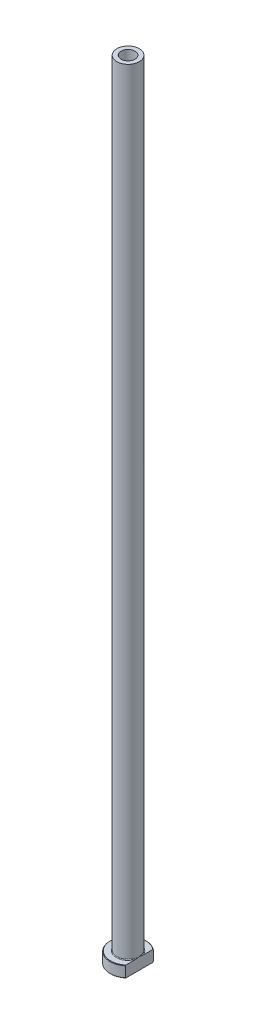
ISO-10303-21;
HEADER;
FILE_DESCRIPTION(('STEP AP214'),'2;1');
FILE_NAME('part.step','',(''),(''),'','','');
FILE_SCHEMA(('AUTOMOTIVE_DESIGN { 1 0 10303 214 1 1 1 1 }'));
ENDSEC;
DATA;
#1=APPLICATION_CONTEXT('core data for automotive mechanical design processes');
#2=APPLICATION_PROTOCOL_DEFINITION('international standard','automotive_design',2000,#1);
#3=PRODUCT_CONTEXT('',#1,'mechanical');
#4=PRODUCT('Part','Part','',(#3));
#5=PRODUCT_RELATED_PRODUCT_CATEGORY('part','',(#4));
#6=PRODUCT_DEFINITION_FORMATION('','',#4);
#7=PRODUCT_DEFINITION_CONTEXT('part definition',#1,'design');
#8=PRODUCT_DEFINITION('design','',#6,#7);
#9=PRODUCT_DEFINITION_SHAPE('','',#8);
#10=(LENGTH_UNIT() NAMED_UNIT(*) SI_UNIT(.MILLI.,.METRE.));
#11=(NAMED_UNIT(*) PLANE_ANGLE_UNIT() SI_UNIT($,.RADIAN.));
#12=(NAMED_UNIT(*) SI_UNIT($,.STERADIAN.) SOLID_ANGLE_UNIT());
#13=UNCERTAINTY_MEASURE_WITH_UNIT(LENGTH_MEASURE(1.E-05),#10,'distance_accuracy_value','');
#14=(GEOMETRIC_REPRESENTATION_CONTEXT(3) GLOBAL_UNCERTAINTY_ASSIGNED_CONTEXT((#13)) GLOBAL_UNIT_ASSIGNED_CONTEXT((#10,
#11,#12)) REPRESENTATION_CONTEXT('',''));
#15=CARTESIAN_POINT('',(0.,0.,0.));
#16=DIRECTION('',(0.,0.,1.));
#17=DIRECTION('',(1.,0.,0.));
#18=AXIS2_PLACEMENT_3D('',#15,#16,#17);
#19=CARTESIAN_POINT('',(0.,92.1876809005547,0.));
#20=DIRECTION('',(0.,1.,0.));
#21=DIRECTION('',(0.,0.,1.));
#22=AXIS2_PLACEMENT_3D('',#19,#20,#21);
#23=CYLINDRICAL_SURFACE('',#22,3.10000000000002);
#24=CARTESIAN_POINT('',(0.,350.,0.));
#25=DIRECTION('',(0.,1.,0.));
#26=DIRECTION('',(0.,0.,1.));
#27=AXIS2_PLACEMENT_3D('',#24,#25,#26);
#28=CIRCLE('',#27,3.10000000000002);
#29=CARTESIAN_POINT('',(0.,350.,3.10000000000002));
#30=VERTEX_POINT('',#29);
#31=EDGE_CURVE('E167',#30,#30,#28,.T.);
#32=ORIENTED_EDGE('',*,*,#31,.T.);
#33=EDGE_LOOP('',(#32));
#34=FACE_BOUND('',#33,.T.);
#35=CARTESIAN_POINT('',(0.,305.,0.));
#36=DIRECTION('',(0.,1.,0.));
#37=DIRECTION('',(0.,0.,1.));
#38=AXIS2_PLACEMENT_3D('',#35,#36,#37);
#39=CIRCLE('',#38,3.10000000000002);
#40=CARTESIAN_POINT('',(0.,305.,3.10000000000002));
#41=VERTEX_POINT('',#40);
#42=EDGE_CURVE('E170',#41,#41,#39,.T.);
#43=ORIENTED_EDGE('',*,*,#42,.F.);
#44=EDGE_LOOP('',(#43));
#45=FACE_BOUND('',#44,.T.);
#46=ADVANCED_FACE('F32',(#34,#45),#23,.F.);
#47=CARTESIAN_POINT('',(-3.10000000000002,350.,0.));
#48=DIRECTION('',(0.,1.,0.));
#49=DIRECTION('',(0.,0.,1.));
#50=AXIS2_PLACEMENT_3D('',#47,#48,#49);
#51=PLANE('',#50);
#52=CARTESIAN_POINT('',(0.,350.,0.));
#53=DIRECTION('',(0.,1.,0.));
#54=DIRECTION('',(0.,0.,1.));
#55=AXIS2_PLACEMENT_3D('',#52,#53,#54);
#56=CIRCLE('',#55,5.00000000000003);
#57=CARTESIAN_POINT('',(0.,350.,5.00000000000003));
#58=VERTEX_POINT('',#57);
#59=EDGE_CURVE('E174',#58,#58,#56,.T.);
#60=ORIENTED_EDGE('',*,*,#59,.T.);
#61=EDGE_LOOP('',(#60));
#62=FACE_BOUND('',#61,.T.);
#63=ORIENTED_EDGE('',*,*,#31,.F.);
#64=EDGE_LOOP('',(#63));
#65=FACE_BOUND('',#64,.T.);
#66=ADVANCED_FACE('F157',(#62,#65),#51,.T.);
#67=CARTESIAN_POINT('',(0.,92.1876809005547,0.));
#68=DIRECTION('',(0.,1.,0.));
#69=DIRECTION('',(0.,0.,1.));
#70=AXIS2_PLACEMENT_3D('',#67,#68,#69);
#71=CYLINDRICAL_SURFACE('',#70,5.00000000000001);
#72=CARTESIAN_POINT('',(0.,5.3,0.));
#73=DIRECTION('',(0.,1.,0.));
#74=DIRECTION('',(0.,0.,1.));
#75=AXIS2_PLACEMENT_3D('',#72,#73,#74);
#76=CIRCLE('',#75,5.00000000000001);
#77=CARTESIAN_POINT('',(5.,5.3,0.));
#78=VERTEX_POINT('',#77);
#79=EDGE_CURVE('E180',#78,#78,#76,.T.);
#80=ORIENTED_EDGE('',*,*,#79,.T.);
#81=EDGE_LOOP('',(#80));
#82=FACE_BOUND('',#81,.T.);
#83=ORIENTED_EDGE('',*,*,#59,.F.);
#84=EDGE_LOOP('',(#83));
#85=FACE_BOUND('',#84,.T.);
#86=ADVANCED_FACE('F162',(#82,#85),#71,.T.);
#87=CARTESIAN_POINT('',(-4.99999999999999,5.,0.));
#88=DIRECTION('',(0.,1.,0.));
#89=DIRECTION('',(0.,0.,1.));
#90=AXIS2_PLACEMENT_3D('',#87,#88,#89);
#91=PLANE('',#90);
#92=DIRECTION('',(0.,0.,1.));
#93=VECTOR('',#92,1.);
#94=CARTESIAN_POINT('',(5.,5.,0.));
#95=LINE('',#94,#93);
#96=CARTESIAN_POINT('',(5.,5.,-5.98665181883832));
#97=VERTEX_POINT('',#96);
#98=CARTESIAN_POINT('',(5.,5.,-1.75783958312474));
#99=VERTEX_POINT('',#98);
#100=EDGE_CURVE('E54',#97,#99,#95,.T.);
#101=ORIENTED_EDGE('',*,*,#100,.F.);
#102=CARTESIAN_POINT('',(0.,5.,0.));
#103=DIRECTION('',(0.,1.,0.));
#104=DIRECTION('',(0.,0.,1.));
#105=AXIS2_PLACEMENT_3D('',#102,#103,#104);
#106=CIRCLE('',#105,7.80000000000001);
#107=CARTESIAN_POINT('',(4.99999999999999,5.,5.98665181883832));
#108=VERTEX_POINT('',#107);
#109=EDGE_CURVE('E186',#97,#108,#106,.T.);
#110=ORIENTED_EDGE('',*,*,#109,.T.);
#111=CARTESIAN_POINT('',(5.,5.,1.75783958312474));
#112=VERTEX_POINT('',#111);
#113=EDGE_CURVE('E134',#112,#108,#95,.T.);
#114=ORIENTED_EDGE('',*,*,#113,.F.);
#115=CARTESIAN_POINT('',(0.,5.,0.));
#116=DIRECTION('',(0.,1.,0.));
#117=DIRECTION('',(0.,0.,1.));
#118=AXIS2_PLACEMENT_3D('',#115,#116,#117);
#119=CIRCLE('',#118,5.30000000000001);
#120=EDGE_CURVE('E183',#112,#99,#119,.F.);
#121=ORIENTED_EDGE('',*,*,#120,.T.);
#122=EDGE_LOOP('',(#101,#110,#114,#121));
#123=FACE_BOUND('',#122,.T.);
#124=ADVANCED_FACE('F197',(#123),#91,.T.);
#125=CARTESIAN_POINT('',(0.,92.1876809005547,0.));
#126=DIRECTION('',(0.,1.,0.));
#127=DIRECTION('',(0.,0.,1.));
#128=AXIS2_PLACEMENT_3D('',#125,#126,#127);
#129=CYLINDRICAL_SURFACE('',#128,7.99999999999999);
#130=DIRECTION('',(0.,-1.,0.));
#131=VECTOR('',#130,1.);
#132=CARTESIAN_POINT('',(4.99999999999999,350.,6.24499799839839));
#133=LINE('',#132,#131);
#134=CARTESIAN_POINT('',(4.99999999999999,4.80000000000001,6.24499799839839));
#135=VERTEX_POINT('',#134);
#136=CARTESIAN_POINT('',(4.99999999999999,0.20000000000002,6.24499799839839));
#137=VERTEX_POINT('',#136);
#138=EDGE_CURVE('E82',#135,#137,#133,.T.);
#139=ORIENTED_EDGE('',*,*,#138,.F.);
#140=CARTESIAN_POINT('',(0.,4.80000000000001,0.));
#141=DIRECTION('',(0.,1.,0.));
#142=DIRECTION('',(0.,0.,1.));
#143=AXIS2_PLACEMENT_3D('',#140,#141,#142);
#144=CIRCLE('',#143,7.99999999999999);
#145=CARTESIAN_POINT('',(5.,4.80000000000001,-6.24499799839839));
#146=VERTEX_POINT('',#145);
#147=EDGE_CURVE('E95',#135,#146,#144,.F.);
#148=ORIENTED_EDGE('',*,*,#147,.T.);
#149=DIRECTION('',(0.,-1.,0.));
#150=VECTOR('',#149,1.);
#151=CARTESIAN_POINT('',(5.,350.,-6.24499799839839));
#152=LINE('',#151,#150);
#153=CARTESIAN_POINT('',(5.,0.20000000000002,-6.24499799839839));
#154=VERTEX_POINT('',#153);
#155=EDGE_CURVE('E192',#146,#154,#152,.T.);
#156=ORIENTED_EDGE('',*,*,#155,.T.);
#157=CARTESIAN_POINT('',(0.,0.20000000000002,0.));
#158=DIRECTION('',(0.,-1.,0.));
#159=DIRECTION('',(0.,0.,-1.));
#160=AXIS2_PLACEMENT_3D('',#157,#158,#159);
#161=CIRCLE('',#160,7.99999999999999);
#162=EDGE_CURVE('E98',#154,#137,#161,.F.);
#163=ORIENTED_EDGE('',*,*,#162,.T.);
#164=EDGE_LOOP('',(#139,#148,#156,#163));
#165=FACE_BOUND('',#164,.T.);
#166=ADVANCED_FACE('F190',(#165),#129,.T.);
#167=CARTESIAN_POINT('',(-7.99999999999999,0.,0.));
#168=DIRECTION('',(0.,-1.,0.));
#169=DIRECTION('',(0.,0.,-1.));
#170=AXIS2_PLACEMENT_3D('',#167,#168,#169);
#171=PLANE('',#170);
#172=CARTESIAN_POINT('',(0.,0.,0.));
#173=DIRECTION('',(0.,-1.,0.));
#174=DIRECTION('',(0.,0.,-1.));
#175=AXIS2_PLACEMENT_3D('',#172,#173,#174);
#176=CIRCLE('',#175,3.84999999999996);
#177=CARTESIAN_POINT('',(0.,0.,-3.84999999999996));
#178=VERTEX_POINT('',#177);
#179=EDGE_CURVE('E40',#178,#178,#176,.F.);
#180=ORIENTED_EDGE('',*,*,#179,.T.);
#181=EDGE_LOOP('',(#180));
#182=FACE_BOUND('',#181,.T.);
#183=DIRECTION('',(0.,0.,-1.));
#184=VECTOR('',#183,1.);
#185=CARTESIAN_POINT('',(4.99999999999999,0.,6.24499799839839));
#186=LINE('',#185,#184);
#187=CARTESIAN_POINT('',(4.99999999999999,0.,5.98665181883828));
#188=VERTEX_POINT('',#187);
#189=CARTESIAN_POINT('',(5.,0.,-5.98665181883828));
#190=VERTEX_POINT('',#189);
#191=EDGE_CURVE('E47',#188,#190,#186,.T.);
#192=ORIENTED_EDGE('',*,*,#191,.F.);
#193=CARTESIAN_POINT('',(0.,0.,0.));
#194=DIRECTION('',(0.,-1.,0.));
#195=DIRECTION('',(0.,0.,-1.));
#196=AXIS2_PLACEMENT_3D('',#193,#194,#195);
#197=CIRCLE('',#196,7.79999999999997);
#198=EDGE_CURVE('E92',#188,#190,#197,.T.);
#199=ORIENTED_EDGE('',*,*,#198,.T.);
#200=EDGE_LOOP('',(#192,#199));
#201=FACE_BOUND('',#200,.T.);
#202=ADVANCED_FACE('F91',(#182,#201),#171,.T.);
#203=CARTESIAN_POINT('',(0.,92.1876809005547,0.));
#204=DIRECTION('',(0.,1.,0.));
#205=DIRECTION('',(0.,0.,1.));
#206=AXIS2_PLACEMENT_3D('',#203,#204,#205);
#207=CYLINDRICAL_SURFACE('',#206,3.35000000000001);
#208=CARTESIAN_POINT('',(0.,0.499999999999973,0.));
#209=DIRECTION('',(0.,-1.,0.));
#210=DIRECTION('',(0.,0.,-1.));
#211=AXIS2_PLACEMENT_3D('',#208,#209,#210);
#212=CIRCLE('',#211,3.35000000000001);
#213=CARTESIAN_POINT('',(0.,0.499999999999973,-3.35000000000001));
#214=VERTEX_POINT('',#213);
#215=EDGE_CURVE('E11',#214,#214,#212,.T.);
#216=ORIENTED_EDGE('',*,*,#215,.T.);
#217=EDGE_LOOP('',(#216));
#218=FACE_BOUND('',#217,.T.);
#219=CARTESIAN_POINT('',(0.,293.,0.));
#220=DIRECTION('',(0.,1.,0.));
#221=DIRECTION('',(0.,0.,1.));
#222=AXIS2_PLACEMENT_3D('',#219,#220,#221);
#223=CIRCLE('',#222,3.35000000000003);
#224=CARTESIAN_POINT('',(0.,293.,3.35000000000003));
#225=VERTEX_POINT('',#224);
#226=EDGE_CURVE('E172',#225,#225,#223,.T.);
#227=ORIENTED_EDGE('',*,*,#226,.T.);
#228=EDGE_LOOP('',(#227));
#229=FACE_BOUND('',#228,.T.);
#230=ADVANCED_FACE('F215',(#218,#229),#207,.F.);
#231=CARTESIAN_POINT('',(0.,293.,0.));
#232=DIRECTION('',(0.,-1.,0.));
#233=DIRECTION('',(0.,0.,-1.));
#234=AXIS2_PLACEMENT_3D('',#231,#232,#233);
#235=CONICAL_SURFACE('',#234,3.35000000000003,0.0208303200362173);
#236=ORIENTED_EDGE('',*,*,#42,.T.);
#237=EDGE_LOOP('',(#236));
#238=FACE_BOUND('',#237,.T.);
#239=ORIENTED_EDGE('',*,*,#226,.F.);
#240=EDGE_LOOP('',(#239));
#241=FACE_BOUND('',#240,.T.);
#242=ADVANCED_FACE('F111',(#238,#241),#235,.F.);
#243=CARTESIAN_POINT('',(0.,5.3,0.));
#244=DIRECTION('',(0.,1.,0.));
#245=DIRECTION('',(0.,0.,1.));
#246=AXIS2_PLACEMENT_3D('',#243,#244,#245);
#247=TOROIDAL_SURFACE('',#246,5.30000000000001,0.3);
#248=ORIENTED_EDGE('',*,*,#120,.F.);
#249=CARTESIAN_POINT('',(5.,5.3,0.));
#250=CARTESIAN_POINT('',(5.,5.3000006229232,-1.3146900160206E-10));
#251=CARTESIAN_POINT('',(5.,5.30000124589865,2.5275949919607E-07));
#252=CARTESIAN_POINT('',(5.,5.30000240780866,9.47164923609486E-07));
#253=CARTESIAN_POINT('',(5.,5.30000293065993,1.40594102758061E-06));
#254=CARTESIAN_POINT('',(5.,5.30000402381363,2.50637697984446E-06));
#255=CARTESIAN_POINT('',(5.,5.30000457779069,3.16589020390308E-06));
#256=CARTESIAN_POINT('',(5.,5.30000556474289,4.52860090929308E-06));
#257=CARTESIAN_POINT('',(5.,5.30000600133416,5.22939564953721E-06));
#258=CARTESIAN_POINT('',(5.,5.30000763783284,7.96122182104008E-06));
#259=CARTESIAN_POINT('',(5.,5.30000875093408,1.00477434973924E-05));
#260=CARTESIAN_POINT('',(5.,5.30001056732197,1.41660902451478E-05));
#261=CARTESIAN_POINT('',(5.,5.30001129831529,1.61861809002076E-05));
#262=CARTESIAN_POINT('',(5.,5.30001439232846,2.47865783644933E-05));
#263=CARTESIAN_POINT('',(5.,5.3000167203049,3.13830342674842E-05));
#264=CARTESIAN_POINT('',(5.,5.30002012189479,4.38084288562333E-05));
#265=CARTESIAN_POINT('',(5.,5.30002133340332,4.95992799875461E-05));
#266=CARTESIAN_POINT('',(5.,5.30003020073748,9.27862708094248E-05));
#267=CARTESIAN_POINT('',(5.,5.30003696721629,0.000130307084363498));
#268=CARTESIAN_POINT('',(4.99999999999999,5.30006659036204,0.000278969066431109));
#269=CARTESIAN_POINT('',(4.99999999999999,5.30009481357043,0.000389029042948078));
#270=CARTESIAN_POINT('',(5.,5.30020506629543,0.000826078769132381));
#271=CARTESIAN_POINT('',(5.,5.30028365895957,0.00115365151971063));
#272=CARTESIAN_POINT('',(4.99999999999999,5.30059919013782,0.00245925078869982));
#273=CARTESIAN_POINT('',(4.99999999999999,5.30084048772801,0.00343651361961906));
#274=CARTESIAN_POINT('',(5.,5.30184626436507,0.00752058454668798));
#275=CARTESIAN_POINT('',(5.,5.30260525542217,0.0106283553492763));
#276=CARTESIAN_POINT('',(4.99999999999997,5.30996461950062,0.0407482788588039));
#277=CARTESIAN_POINT('',(4.99999999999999,5.31658985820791,0.0677561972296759));
#278=CARTESIAN_POINT('',(5.,5.32953319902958,0.120688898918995));
#279=CARTESIAN_POINT('',(5.,5.33585289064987,0.146613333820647));
#280=CARTESIAN_POINT('',(4.99999999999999,5.34926050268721,0.201795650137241));
#281=CARTESIAN_POINT('',(4.99999999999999,5.35634306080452,0.231054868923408));
#282=CARTESIAN_POINT('',(5.,5.370502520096,0.289917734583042));
#283=CARTESIAN_POINT('',(5.,5.37757848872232,0.319521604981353));
#284=CARTESIAN_POINT('',(5.,5.39452602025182,0.391032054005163));
#285=CARTESIAN_POINT('',(5.,5.40434071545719,0.432952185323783));
#286=CARTESIAN_POINT('',(5.,5.42340141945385,0.515763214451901));
#287=CARTESIAN_POINT('',(5.,5.43265559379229,0.556652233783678));
#288=CARTESIAN_POINT('',(5.,5.45710553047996,0.667075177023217));
#289=CARTESIAN_POINT('',(5.,5.47194176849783,0.736689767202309));
#290=CARTESIAN_POINT('',(5.,5.50018229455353,0.87683662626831));
#291=CARTESIAN_POINT('',(5.,5.51357312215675,0.947371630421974));
#292=CARTESIAN_POINT('',(5.,5.53930921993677,1.09497328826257));
#293=CARTESIAN_POINT('',(5.,5.55146217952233,1.17207432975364));
#294=CARTESIAN_POINT('',(5.,5.57239669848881,1.32672649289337));
#295=CARTESIAN_POINT('',(5.,5.58117877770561,1.40427754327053));
#296=CARTESIAN_POINT('',(5.,5.59499725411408,1.5687382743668));
#297=CARTESIAN_POINT('',(5.,5.59948802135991,1.6557004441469));
#298=CARTESIAN_POINT('',(5.,5.60018885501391,1.78535304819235));
#299=CARTESIAN_POINT('',(5.,5.59945214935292,1.82802575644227));
#300=CARTESIAN_POINT('',(5.,5.59559364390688,1.9132508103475));
#301=CARTESIAN_POINT('',(5.,5.59247319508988,1.95580321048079));
#302=CARTESIAN_POINT('',(5.,5.58383242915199,2.03512365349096));
#303=CARTESIAN_POINT('',(5.,5.57867386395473,2.07192937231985));
#304=CARTESIAN_POINT('',(5.,5.56543793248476,2.14526756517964));
#305=CARTESIAN_POINT('',(5.,5.55734203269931,2.18179676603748));
#306=CARTESIAN_POINT('',(5.,5.53718005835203,2.25427226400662));
#307=CARTESIAN_POINT('',(5.,5.52507057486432,2.29020746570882));
#308=CARTESIAN_POINT('',(5.,5.50270928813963,2.34223029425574));
#309=CARTESIAN_POINT('',(5.,5.49457811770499,2.35922314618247));
#310=CARTESIAN_POINT('',(5.,5.47657809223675,2.39224900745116));
#311=CARTESIAN_POINT('',(5.,5.4667128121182,2.40828390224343));
#312=CARTESIAN_POINT('',(5.,5.44695893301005,2.43579467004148));
#313=CARTESIAN_POINT('',(5.,5.43745879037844,2.44754592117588));
#314=CARTESIAN_POINT('',(5.,5.41677914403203,2.4694647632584));
#315=CARTESIAN_POINT('',(5.,5.40560543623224,2.47963758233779));
#316=CARTESIAN_POINT('',(5.,5.38617750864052,2.49393642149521));
#317=CARTESIAN_POINT('',(5.,5.37851643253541,2.49886271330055));
#318=CARTESIAN_POINT('',(5.,5.36252740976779,2.50749953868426));
#319=CARTESIAN_POINT('',(5.,5.35419984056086,2.51121075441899));
#320=CARTESIAN_POINT('',(5.,5.3369064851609,2.51712941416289));
#321=CARTESIAN_POINT('',(5.,5.32793451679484,2.51931927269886));
#322=CARTESIAN_POINT('',(5.,5.30973576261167,2.52185978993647));
#323=CARTESIAN_POINT('',(5.,5.3005093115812,2.52221275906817));
#324=CARTESIAN_POINT('',(5.,5.28349166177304,2.52112455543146));
#325=CARTESIAN_POINT('',(5.,5.27568322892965,2.51993178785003));
#326=CARTESIAN_POINT('',(5.,5.26036860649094,2.51628294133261));
#327=CARTESIAN_POINT('',(5.,5.25286261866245,2.51382603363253));
#328=CARTESIAN_POINT('',(5.,5.23590266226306,2.5068548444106));
#329=CARTESIAN_POINT('',(5.,5.22661875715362,2.50192984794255));
#330=CARTESIAN_POINT('',(5.,5.20895514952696,2.49066548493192));
#331=CARTESIAN_POINT('',(5.,5.20057756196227,2.48432291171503));
#332=CARTESIAN_POINT('',(5.,5.17987008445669,2.4664521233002));
#333=CARTESIAN_POINT('',(5.,5.16824151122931,2.45411867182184));
#334=CARTESIAN_POINT('',(5.,5.14692461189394,2.42790849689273));
#335=CARTESIAN_POINT('',(5.,5.13723987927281,2.41402898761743));
#336=CARTESIAN_POINT('',(5.,5.11080706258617,2.37143175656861));
#337=CARTESIAN_POINT('',(5.,5.09628770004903,2.34134703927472));
#338=CARTESIAN_POINT('',(5.,5.07130349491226,2.27940731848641));
#339=CARTESIAN_POINT('',(5.,5.06087110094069,2.24754035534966));
#340=CARTESIAN_POINT('',(5.,5.03890359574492,2.16787245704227));
#341=CARTESIAN_POINT('',(5.,5.02913523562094,2.11959065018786));
#342=CARTESIAN_POINT('',(5.,5.0141695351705,2.02224928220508));
#343=CARTESIAN_POINT('',(5.,5.00898637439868,1.97318778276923));
#344=CARTESIAN_POINT('',(5.,5.00220823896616,1.87635767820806));
#345=CARTESIAN_POINT('',(5.,5.00050709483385,1.82859609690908));
#346=CARTESIAN_POINT('',(5.,4.99969104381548,1.73330165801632));
#347=CARTESIAN_POINT('',(5.,5.00056327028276,1.68576884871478));
#348=CARTESIAN_POINT('',(5.,5.00484296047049,1.57937770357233));
#349=CARTESIAN_POINT('',(5.,5.00880932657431,1.52054285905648));
#350=CARTESIAN_POINT('',(5.,5.01925964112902,1.40312974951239));
#351=CARTESIAN_POINT('',(5.,5.02574264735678,1.34455139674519));
#352=CARTESIAN_POINT('',(5.,5.04090087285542,1.22627662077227));
#353=CARTESIAN_POINT('',(5.,5.04962425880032,1.16658647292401));
#354=CARTESIAN_POINT('',(5.,5.06877923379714,1.04732463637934));
#355=CARTESIAN_POINT('',(5.,5.07921523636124,0.987753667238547));
#356=CARTESIAN_POINT('',(5.,5.10551698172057,0.84693616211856));
#357=CARTESIAN_POINT('',(5.,5.12196565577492,0.765799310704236));
#358=CARTESIAN_POINT('',(5.,5.15639716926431,0.604819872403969));
#359=CARTESIAN_POINT('',(4.99999999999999,5.17436050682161,0.524973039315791));
#360=CARTESIAN_POINT('',(5.,5.20921667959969,0.37472665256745));
#361=CARTESIAN_POINT('',(5.,5.22599388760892,0.304300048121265));
#362=CARTESIAN_POINT('',(4.99999999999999,5.25191105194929,0.196907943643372));
#363=CARTESIAN_POINT('',(4.99999999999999,5.26090146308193,0.159905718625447));
#364=CARTESIAN_POINT('',(5.,5.27881854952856,0.0865164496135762));
#365=CARTESIAN_POINT('',(5.00000000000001,5.2877439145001,0.050129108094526));
#366=CARTESIAN_POINT('',(4.99999999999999,5.29739627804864,0.0106218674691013));
#367=CARTESIAN_POINT('',(4.99999999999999,5.29815688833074,0.00750762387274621));
#368=CARTESIAN_POINT('',(5.,5.29916304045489,0.00342209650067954));
#369=CARTESIAN_POINT('',(5.,5.29940309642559,0.00244985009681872));
#370=CARTESIAN_POINT('',(4.99999999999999,5.29971711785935,0.00115049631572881));
#371=CARTESIAN_POINT('',(4.99999999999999,5.29979541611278,0.000824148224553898));
#372=CARTESIAN_POINT('',(5.,5.29990531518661,0.00038852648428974));
#373=CARTESIAN_POINT('',(5.,5.29993348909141,0.000278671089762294));
#374=CARTESIAN_POINT('',(5.,5.29996306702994,0.000130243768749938));
#375=CARTESIAN_POINT('',(4.99999999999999,5.29996982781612,9.27511472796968E-05));
#376=CARTESIAN_POINT('',(5.,5.29997868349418,4.95929950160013E-05));
#377=CARTESIAN_POINT('',(5.,5.29997989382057,4.38036623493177E-05));
#378=CARTESIAN_POINT('',(5.,5.29998329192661,3.13814244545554E-05));
#379=CARTESIAN_POINT('',(5.,5.29998561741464,2.47865262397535E-05));
#380=CARTESIAN_POINT('',(5.,5.29998870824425,1.61877572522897E-05));
#381=CARTESIAN_POINT('',(5.,5.29998943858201,1.41677797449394E-05));
#382=CARTESIAN_POINT('',(5.,5.29999125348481,1.00495556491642E-05));
#383=CARTESIAN_POINT('',(5.,5.29999236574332,7.9630285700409E-06));
#384=CARTESIAN_POINT('',(5.,5.29999400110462,5.23107535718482E-06));
#385=CARTESIAN_POINT('',(5.,5.29999443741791,4.53021160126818E-06));
#386=CARTESIAN_POINT('',(5.,5.29999542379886,3.1673126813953E-06));
#387=CARTESIAN_POINT('',(5.,5.29999597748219,2.50767819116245E-06));
#388=CARTESIAN_POINT('',(5.,5.29999707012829,1.40695944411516E-06));
#389=CARTESIAN_POINT('',(5.,5.29999759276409,9.48033029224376E-07));
#390=CARTESIAN_POINT('',(5.,5.29999875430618,2.53244607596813E-07));
#391=CARTESIAN_POINT('',(5.,5.29999937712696,1.31459803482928E-10));
#392=CARTESIAN_POINT('',(5.,5.3,0.));
#393=B_SPLINE_CURVE_WITH_KNOTS('',3,(#249,#250,#251,#252,#253,#254,#255,#256,#257,#258,#259,
#260,#261,#262,#263,#264,#265,#266,#267,#268,#269,#270,#271,#272,#273,#274,#275,#276,#277,#278,
#279,#280,#281,#282,#283,#284,#285,#286,#287,#288,#289,#290,#291,#292,#293,#294,#295,#296,#297,
#298,#299,#300,#301,#302,#303,#304,#305,#306,#307,#308,#309,#310,#311,#312,#313,#314,#315,#316,
#317,#318,#319,#320,#321,#322,#323,#324,#325,#326,#327,#328,#329,#330,#331,#332,#333,#334,#335,
#336,#337,#338,#339,#340,#341,#342,#343,#344,#345,#346,#347,#348,#349,#350,#351,#352,#353,#354,
#355,#356,#357,#358,#359,#360,#361,#362,#363,#364,#365,#366,#367,#368,#369,#370,#371,#372,#373,
#374,#375,#376,#377,#378,#379,#380,#381,#382,#383,#384,#385,#386,#387,#388,#389,#390,#391,#392),
.UNSPECIFIED.,.T.,.F.,(4,2,2,2,2,2,2,2,2,2,2,2,2,2,2,2,2,2,2,2,2,2,2,2,2,2,2,2,2,2,2,2,2,2,2,2,
2,2,2,2,2,2,2,2,2,2,2,2,2,2,2,2,2,2,2,2,2,2,2,2,2,2,2,2,2,2,2,2,2,2,2,4),(0.,
1.88938973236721E-06,3.98058305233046E-06,6.54817790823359E-06,9.02403411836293E-06,
1.60938640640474E-05,2.25328058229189E-05,4.34843790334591E-05,6.12120027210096E-05,
0.000175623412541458,0.000516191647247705,0.00152710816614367,0.00454656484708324,
0.0141443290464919,0.0975679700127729,0.177619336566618,0.267931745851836,0.35924502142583,
0.4884051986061,0.614173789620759,0.827694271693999,1.04305715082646,1.27715608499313,
1.51121890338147,1.77214751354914,1.90013509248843,2.028050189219,2.13945459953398,
2.25157451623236,2.36494894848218,2.42139235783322,2.4777207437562,2.5229380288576,
2.5680021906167,2.59524342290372,2.62246933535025,2.65000494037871,2.67750590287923,
2.70108948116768,2.72468854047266,2.75603978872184,2.78746268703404,2.8380280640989,
2.8886860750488,2.98834295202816,3.08877575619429,3.23618650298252,3.38405153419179,
3.52733651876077,3.66990630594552,3.84673903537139,4.02350562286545,4.20444776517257,
4.38586374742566,4.63419556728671,4.87971270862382,5.09690175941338,5.21113882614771,
5.32353360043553,5.33315137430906,5.33615533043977,5.33716246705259,5.33750240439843,
5.33761672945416,5.33763445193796,5.33765539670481,5.33766183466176,5.33766890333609,
5.33767137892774,5.33767394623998,5.33767603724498,5.33767792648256),.UNSPECIFIED.);
#394=EDGE_CURVE('E126',#112,#78,#393,.T.);
#395=ORIENTED_EDGE('',*,*,#394,.T.);
#396=ORIENTED_EDGE('',*,*,#79,.F.);
#397=CARTESIAN_POINT('',(5.,5.3,0.));
#398=CARTESIAN_POINT('',(5.,5.2999993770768,1.31470615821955E-10));
#399=CARTESIAN_POINT('',(5.,5.29999875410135,-2.52759497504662E-07));
#400=CARTESIAN_POINT('',(5.,5.29999759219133,-9.47164922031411E-07));
#401=CARTESIAN_POINT('',(5.,5.29999706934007,-1.40594102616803E-06));
#402=CARTESIAN_POINT('',(5.,5.29999597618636,-2.50637697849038E-06));
#403=CARTESIAN_POINT('',(5.,5.29999542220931,-3.16589020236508E-06));
#404=CARTESIAN_POINT('',(5.,5.2999944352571,-4.52860090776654E-06));
#405=CARTESIAN_POINT('',(5.,5.29999399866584,-5.2293956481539E-06));
#406=CARTESIAN_POINT('',(5.,5.29999236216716,-7.96122182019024E-06));
#407=CARTESIAN_POINT('',(5.,5.29999124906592,-1.00477434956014E-05));
#408=CARTESIAN_POINT('',(5.,5.29998943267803,-1.41660902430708E-05));
#409=CARTESIAN_POINT('',(5.,5.29998870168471,-1.61861808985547E-05));
#410=CARTESIAN_POINT('',(5.,5.29998560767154,-2.47865783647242E-05));
#411=CARTESIAN_POINT('',(5.,5.2999832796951,-3.1383034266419E-05));
#412=CARTESIAN_POINT('',(5.,5.29997987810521,-4.38084288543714E-05));
#413=CARTESIAN_POINT('',(5.,5.29997866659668,-4.9599279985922E-05));
#414=CARTESIAN_POINT('',(5.,5.29996979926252,-9.2786270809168E-05));
#415=CARTESIAN_POINT('',(5.,5.2999630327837,-0.000130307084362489));
#416=CARTESIAN_POINT('',(4.99999999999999,5.29993340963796,-0.000278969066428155));
#417=CARTESIAN_POINT('',(4.99999999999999,5.29990518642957,-0.000389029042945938));
#418=CARTESIAN_POINT('',(5.,5.29979493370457,-0.000826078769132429));
#419=CARTESIAN_POINT('',(5.,5.29971634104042,-0.00115365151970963));
#420=CARTESIAN_POINT('',(4.99999999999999,5.29940080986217,-0.00245925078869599));
#421=CARTESIAN_POINT('',(4.99999999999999,5.29915951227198,-0.00343651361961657));
#422=CARTESIAN_POINT('',(5.00000000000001,5.29815373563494,-0.00752058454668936));
#423=CARTESIAN_POINT('',(5.,5.29739474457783,-0.0106283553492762));
#424=CARTESIAN_POINT('',(4.99999999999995,5.29003538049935,-0.0407482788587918));
#425=CARTESIAN_POINT('',(4.99999999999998,5.28341014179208,-0.0677561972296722));
#426=CARTESIAN_POINT('',(5.00000000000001,5.27046680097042,-0.120688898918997));
#427=CARTESIAN_POINT('',(5.,5.26414710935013,-0.146613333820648));
#428=CARTESIAN_POINT('',(4.99999999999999,5.25073949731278,-0.20179565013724));
#429=CARTESIAN_POINT('',(4.99999999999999,5.24365693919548,-0.231054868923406));
#430=CARTESIAN_POINT('',(5.,5.229497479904,-0.289917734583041));
#431=CARTESIAN_POINT('',(5.,5.22242151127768,-0.319521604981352));
#432=CARTESIAN_POINT('',(4.99999999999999,5.20547397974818,-0.391032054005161));
#433=CARTESIAN_POINT('',(5.,5.19565928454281,-0.432952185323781));
#434=CARTESIAN_POINT('',(5.,5.17659858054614,-0.515763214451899));
#435=CARTESIAN_POINT('',(5.,5.16734440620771,-0.556652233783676));
#436=CARTESIAN_POINT('',(5.,5.14289446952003,-0.667075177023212));
#437=CARTESIAN_POINT('',(5.,5.12805823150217,-0.736689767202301));
#438=CARTESIAN_POINT('',(5.,5.09981770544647,-0.876836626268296));
#439=CARTESIAN_POINT('',(5.,5.08642687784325,-0.947371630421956));
#440=CARTESIAN_POINT('',(5.,5.06069078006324,-1.09497328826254));
#441=CARTESIAN_POINT('',(5.,5.04853782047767,-1.17207432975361));
#442=CARTESIAN_POINT('',(5.,5.02760330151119,-1.32672649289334));
#443=CARTESIAN_POINT('',(5.,5.01882122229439,-1.40427754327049));
#444=CARTESIAN_POINT('',(5.,5.00500274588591,-1.56873827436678));
#445=CARTESIAN_POINT('',(5.,5.00051197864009,-1.6557004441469));
#446=CARTESIAN_POINT('',(5.,4.99981114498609,-1.78535304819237));
#447=CARTESIAN_POINT('',(5.,5.00054785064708,-1.82802575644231));
#448=CARTESIAN_POINT('',(5.,5.00440635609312,-1.91325081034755));
#449=CARTESIAN_POINT('',(5.,5.00752680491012,-1.95580321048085));
#450=CARTESIAN_POINT('',(5.,5.01616757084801,-2.035123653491));
#451=CARTESIAN_POINT('',(5.,5.02132613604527,-2.07192937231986));
#452=CARTESIAN_POINT('',(5.,5.03456206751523,-2.14526756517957));
#453=CARTESIAN_POINT('',(5.,5.04265796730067,-2.18179676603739));
#454=CARTESIAN_POINT('',(5.,5.06281994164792,-2.25427226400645));
#455=CARTESIAN_POINT('',(5.,5.07492942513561,-2.29020746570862));
#456=CARTESIAN_POINT('',(5.,5.09729071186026,-2.34223029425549));
#457=CARTESIAN_POINT('',(5.,5.10542188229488,-2.35922314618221));
#458=CARTESIAN_POINT('',(5.,5.12342190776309,-2.39224900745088));
#459=CARTESIAN_POINT('',(5.,5.13328718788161,-2.40828390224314));
#460=CARTESIAN_POINT('',(5.,5.15304106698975,-2.43579467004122));
#461=CARTESIAN_POINT('',(5.,5.16254120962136,-2.44754592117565));
#462=CARTESIAN_POINT('',(5.,5.18322085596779,-2.46946476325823));
#463=CARTESIAN_POINT('',(5.,5.19439456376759,-2.47963758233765));
#464=CARTESIAN_POINT('',(5.,5.21382249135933,-2.49393642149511));
#465=CARTESIAN_POINT('',(5.,5.22148356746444,-2.49886271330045));
#466=CARTESIAN_POINT('',(5.,5.23747259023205,-2.50749953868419));
#467=CARTESIAN_POINT('',(5.,5.24580015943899,-2.51121075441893));
#468=CARTESIAN_POINT('',(5.,5.26309351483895,-2.51712941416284));
#469=CARTESIAN_POINT('',(5.,5.27206548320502,-2.51931927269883));
#470=CARTESIAN_POINT('',(5.,5.29026423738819,-2.52185978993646));
#471=CARTESIAN_POINT('',(5.,5.29949068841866,-2.52221275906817));
#472=CARTESIAN_POINT('',(5.,5.31650833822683,-2.52112455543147));
#473=CARTESIAN_POINT('',(5.,5.32431677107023,-2.51993178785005));
#474=CARTESIAN_POINT('',(5.,5.33963139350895,-2.51628294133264));
#475=CARTESIAN_POINT('',(5.,5.34713738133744,-2.51382603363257));
#476=CARTESIAN_POINT('',(5.,5.36409733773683,-2.50685484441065));
#477=CARTESIAN_POINT('',(5.,5.37338124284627,-2.50192984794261));
#478=CARTESIAN_POINT('',(5.,5.39104485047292,-2.490665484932));
#479=CARTESIAN_POINT('',(5.,5.3994224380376,-2.48432291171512));
#480=CARTESIAN_POINT('',(5.,5.42012991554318,-2.46645212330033));
#481=CARTESIAN_POINT('',(5.,5.43175848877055,-2.45411867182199));
#482=CARTESIAN_POINT('',(5.,5.45307538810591,-2.42790849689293));
#483=CARTESIAN_POINT('',(5.,5.46276012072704,-2.41402898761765));
#484=CARTESIAN_POINT('',(5.,5.48919293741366,-2.37143175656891));
#485=CARTESIAN_POINT('',(5.,5.5037122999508,-2.34134703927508));
#486=CARTESIAN_POINT('',(5.,5.52869650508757,-2.27940731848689));
#487=CARTESIAN_POINT('',(5.,5.53912889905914,-2.24754035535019));
#488=CARTESIAN_POINT('',(5.,5.56109640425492,-2.16787245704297));
#489=CARTESIAN_POINT('',(5.,5.5708647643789,-2.11959065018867));
#490=CARTESIAN_POINT('',(5.,5.58583046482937,-2.02224928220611));
#491=CARTESIAN_POINT('',(5.,5.59101362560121,-1.97318778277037));
#492=CARTESIAN_POINT('',(5.,5.59779176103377,-1.87635767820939));
#493=CARTESIAN_POINT('',(5.,5.5994929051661,-1.82859609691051));
#494=CARTESIAN_POINT('',(5.,5.60030895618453,-1.73330165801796));
#495=CARTESIAN_POINT('',(5.,5.59943672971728,-1.68576884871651));
#496=CARTESIAN_POINT('',(5.,5.59515703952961,-1.57937770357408));
#497=CARTESIAN_POINT('',(5.,5.59119067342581,-1.52054285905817));
#498=CARTESIAN_POINT('',(5.,5.58074035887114,-1.40312974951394));
#499=CARTESIAN_POINT('',(5.,5.57425735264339,-1.34455139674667));
#500=CARTESIAN_POINT('',(5.,5.55909912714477,-1.22627662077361));
#501=CARTESIAN_POINT('',(5.,5.55037574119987,-1.16658647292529));
#502=CARTESIAN_POINT('',(5.,5.53122076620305,-1.04732463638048));
#503=CARTESIAN_POINT('',(5.,5.52078476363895,-0.987753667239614));
#504=CARTESIAN_POINT('',(5.,5.49448301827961,-0.846936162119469));
#505=CARTESIAN_POINT('',(4.99999999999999,5.47803434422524,-0.765799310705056));
#506=CARTESIAN_POINT('',(5.,5.44360283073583,-0.604819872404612));
#507=CARTESIAN_POINT('',(5.,5.42563949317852,-0.524973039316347));
#508=CARTESIAN_POINT('',(4.99999999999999,5.3907833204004,-0.374726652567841));
#509=CARTESIAN_POINT('',(4.99999999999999,5.37400611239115,-0.304300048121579));
#510=CARTESIAN_POINT('',(5.,5.34808894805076,-0.196907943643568));
#511=CARTESIAN_POINT('',(5.00000000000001,5.33909853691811,-0.159905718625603));
#512=CARTESIAN_POINT('',(4.99999999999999,5.32118145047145,-0.0865164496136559));
#513=CARTESIAN_POINT('',(4.99999999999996,5.31225608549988,-0.0501291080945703));
#514=CARTESIAN_POINT('',(5.,5.30260372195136,-0.0106218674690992));
#515=CARTESIAN_POINT('',(5.,5.30184311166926,-0.00750762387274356));
#516=CARTESIAN_POINT('',(4.99999999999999,5.30083695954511,-0.00342209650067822));
#517=CARTESIAN_POINT('',(4.99999999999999,5.30059690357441,-0.00244985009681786));
#518=CARTESIAN_POINT('',(5.,5.30028288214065,-0.00115049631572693));
#519=CARTESIAN_POINT('',(5.,5.30020458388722,-0.000824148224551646));
#520=CARTESIAN_POINT('',(4.99999999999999,5.30009468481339,-0.000388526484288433));
#521=CARTESIAN_POINT('',(4.99999999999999,5.30006651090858,-0.00027867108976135));
#522=CARTESIAN_POINT('',(5.,5.30003693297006,-0.000130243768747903));
#523=CARTESIAN_POINT('',(5.,5.30003017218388,-9.2751147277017E-05));
#524=CARTESIAN_POINT('',(5.,5.30002131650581,-4.95929950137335E-05));
#525=CARTESIAN_POINT('',(5.,5.30002010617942,-4.38036623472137E-05));
#526=CARTESIAN_POINT('',(5.,5.30001670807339,-3.13814244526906E-05));
#527=CARTESIAN_POINT('',(5.,5.30001438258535,-2.4786526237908E-05));
#528=CARTESIAN_POINT('',(5.,5.30001129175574,-1.61877572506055E-05));
#529=CARTESIAN_POINT('',(5.,5.30001056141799,-1.41677797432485E-05));
#530=CARTESIAN_POINT('',(5.,5.30000874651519,-1.00495556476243E-05));
#531=CARTESIAN_POINT('',(5.,5.30000763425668,-7.9630285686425E-06));
#532=CARTESIAN_POINT('',(5.,5.30000599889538,-5.23107535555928E-06));
#533=CARTESIAN_POINT('',(5.,5.30000556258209,-4.53021159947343E-06));
#534=CARTESIAN_POINT('',(5.,5.30000457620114,-3.16731267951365E-06));
#535=CARTESIAN_POINT('',(5.,5.30000402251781,-2.50767818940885E-06));
#536=CARTESIAN_POINT('',(5.,5.30000292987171,-1.40695944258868E-06));
#537=CARTESIAN_POINT('',(5.,5.30000240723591,-9.48033027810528E-07));
#538=CARTESIAN_POINT('',(5.,5.30000124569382,-2.53244606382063E-07));
#539=CARTESIAN_POINT('',(5.,5.30000062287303,-1.31458639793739E-10));
#540=CARTESIAN_POINT('',(5.,5.3,0.));
#541=B_SPLINE_CURVE_WITH_KNOTS('',3,(#397,#398,#399,#400,#401,#402,#403,#404,#405,#406,#407,
#408,#409,#410,#411,#412,#413,#414,#415,#416,#417,#418,#419,#420,#421,#422,#423,#424,#425,#426,
#427,#428,#429,#430,#431,#432,#433,#434,#435,#436,#437,#438,#439,#440,#441,#442,#443,#444,#445,
#446,#447,#448,#449,#450,#451,#452,#453,#454,#455,#456,#457,#458,#459,#460,#461,#462,#463,#464,
#465,#466,#467,#468,#469,#470,#471,#472,#473,#474,#475,#476,#477,#478,#479,#480,#481,#482,#483,
#484,#485,#486,#487,#488,#489,#490,#491,#492,#493,#494,#495,#496,#497,#498,#499,#500,#501,#502,
#503,#504,#505,#506,#507,#508,#509,#510,#511,#512,#513,#514,#515,#516,#517,#518,#519,#520,#521,
#522,#523,#524,#525,#526,#527,#528,#529,#530,#531,#532,#533,#534,#535,#536,#537,#538,#539,#540),
.UNSPECIFIED.,.T.,.F.,(4,2,2,2,2,2,2,2,2,2,2,2,2,2,2,2,2,2,2,2,2,2,2,2,2,2,2,2,2,2,2,2,2,2,2,2,
2,2,2,2,2,2,2,2,2,2,2,2,2,2,2,2,2,2,2,2,2,2,2,2,2,2,2,2,2,2,2,2,2,2,2,4),(0.,
1.8893897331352E-06,3.98058305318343E-06,6.54817790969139E-06,9.02403411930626E-06,
1.60938640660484E-05,2.25328058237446E-05,4.34843790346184E-05,6.12120027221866E-05,
0.000175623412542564,0.000516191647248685,0.00152710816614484,0.00454656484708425,
0.0141443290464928,0.097567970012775,0.17761933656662,0.267931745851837,0.35924502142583,
0.4884051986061,0.61417378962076,0.82769427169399,1.04305715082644,1.27715608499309,
1.51121890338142,1.77214751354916,1.90013509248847,2.02805018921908,2.13945459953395,
2.25157451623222,2.36494894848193,2.42139235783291,2.47772074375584,2.52293802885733,
2.56800219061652,2.59524342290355,2.6224693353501,2.65000494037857,2.6775059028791,
2.70108948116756,2.72468854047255,2.75603978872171,2.78746268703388,2.83802806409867,
2.88868607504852,2.98834295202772,3.08877575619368,3.23618650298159,3.38405153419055,
3.52733651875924,3.6699063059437,3.84673903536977,4.02350562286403,4.20444776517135,
4.38586374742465,4.63419556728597,4.87971270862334,5.09690175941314,5.21113882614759,
5.32353360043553,5.33315137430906,5.33615533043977,5.33716246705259,5.33750240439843,
5.33761672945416,5.33763445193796,5.33765539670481,5.33766183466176,5.33766890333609,
5.33767137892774,5.33767394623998,5.33767603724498,5.33767792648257),.UNSPECIFIED.);
#542=EDGE_CURVE('E135',#78,#99,#541,.T.);
#543=ORIENTED_EDGE('',*,*,#542,.T.);
#544=EDGE_LOOP('',(#248,#395,#396,#543));
#545=FACE_BOUND('',#544,.T.);
#546=ADVANCED_FACE('F141',(#545),#247,.F.);
#547=CARTESIAN_POINT('',(0.,5.,0.));
#548=DIRECTION('',(0.,-1.,0.));
#549=DIRECTION('',(0.,0.,-1.));
#550=AXIS2_PLACEMENT_3D('',#547,#548,#549);
#551=CONICAL_SURFACE('',#550,7.8,0.78539816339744);
#552=CARTESIAN_POINT('',(5.,-1.82162423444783,-13.7401563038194));
#553=CARTESIAN_POINT('',(5.,-1.61889813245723,-13.5244204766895));
#554=CARTESIAN_POINT('',(5.,-1.41646387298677,-13.3084101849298));
#555=CARTESIAN_POINT('',(5.,-1.01227657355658,-12.8757508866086));
#556=CARTESIAN_POINT('',(5.,-0.81052353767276,-12.6591018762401));
#557=CARTESIAN_POINT('',(5.,-0.206157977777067,-12.0077661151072));
#558=CARTESIAN_POINT('',(5.,0.195280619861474,-11.5719884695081));
#559=CARTESIAN_POINT('',(5.,1.00388282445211,-10.6856136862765));
#560=CARTESIAN_POINT('',(5.,1.41093902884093,-10.2349182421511));
#561=CARTESIAN_POINT('',(5.,2.01658324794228,-9.55471676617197));
#562=CARTESIAN_POINT('',(5.,2.21758236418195,-9.32735800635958));
#563=CARTESIAN_POINT('',(5.,2.61761142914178,-8.87091599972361));
#564=CARTESIAN_POINT('',(5.,2.81664139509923,-8.64183276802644));
#565=CARTESIAN_POINT('',(5.,3.21217345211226,-8.18170099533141));
#566=CARTESIAN_POINT('',(5.,3.40867681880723,-7.95065355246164));
#567=CARTESIAN_POINT('',(5.,3.79865427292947,-7.4859998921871));
#568=CARTESIAN_POINT('',(5.,3.99212827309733,-7.25239360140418));
#569=CARTESIAN_POINT('',(5.,4.37558160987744,-6.78155890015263));
#570=CARTESIAN_POINT('',(5.,4.56555334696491,-6.54432428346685));
#571=CARTESIAN_POINT('',(5.,4.94042138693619,-6.06589574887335));
#572=CARTESIAN_POINT('',(5.,5.12531810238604,-5.82470215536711));
#573=CARTESIAN_POINT('',(5.,5.48653546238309,-5.33972956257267));
#574=CARTESIAN_POINT('',(5.,5.6629239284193,-5.09600137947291));
#575=CARTESIAN_POINT('',(5.,6.00675382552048,-4.60213647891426));
#576=CARTESIAN_POINT('',(5.,6.17419169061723,-4.35199726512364));
#577=CARTESIAN_POINT('',(5.,6.49592993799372,-3.84445040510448));
#578=CARTESIAN_POINT('',(5.,6.65027272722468,-3.58707012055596));
#579=CARTESIAN_POINT('',(5.,6.86813414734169,-3.19356592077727));
#580=CARTESIAN_POINT('',(5.,6.93845533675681,-3.06120993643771));
#581=CARTESIAN_POINT('',(5.,7.07360441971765,-2.79373319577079));
#582=CARTESIAN_POINT('',(5.,7.13843319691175,-2.65861288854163));
#583=CARTESIAN_POINT('',(5.,7.26869642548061,-2.3693638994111));
#584=CARTESIAN_POINT('',(5.,7.33331212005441,-2.21486278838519));
#585=CARTESIAN_POINT('',(5.,7.45243473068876,-1.9019407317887));
#586=CARTESIAN_POINT('',(5.,7.50694001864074,-1.74351915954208));
#587=CARTESIAN_POINT('',(5.,7.60343746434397,-1.42384276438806));
#588=CARTESIAN_POINT('',(5.,7.64549910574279,-1.26260921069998));
#589=CARTESIAN_POINT('',(5.,7.71543089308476,-0.937062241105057));
#590=CARTESIAN_POINT('',(5.,7.74330266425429,-0.772749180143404));
#591=CARTESIAN_POINT('',(5.,7.78344284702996,-0.439876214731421));
#592=CARTESIAN_POINT('',(5.,7.79548961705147,-0.271289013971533));
#593=CARTESIAN_POINT('',(5.,7.80240809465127,0.066227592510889));
#594=CARTESIAN_POINT('',(5.,7.79728142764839,0.235156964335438));
#595=CARTESIAN_POINT('',(5.,7.77017954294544,0.572209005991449));
#596=CARTESIAN_POINT('',(5.,7.74814735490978,0.740327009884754));
#597=CARTESIAN_POINT('',(5.,7.68863212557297,1.0737984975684));
#598=CARTESIAN_POINT('',(5.,7.65114437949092,1.23915112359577));
#599=CARTESIAN_POINT('',(5.,7.54734433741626,1.62344926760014));
#600=CARTESIAN_POINT('',(5.,7.47553580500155,1.84089917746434));
#601=CARTESIAN_POINT('',(5.,7.31300119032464,2.26856946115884));
#602=CARTESIAN_POINT('',(5.,7.22226460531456,2.47878574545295));
#603=CARTESIAN_POINT('',(5.,7.07492970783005,2.7901406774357));
#604=CARTESIAN_POINT('',(5.,7.02362278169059,2.89384077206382));
#605=CARTESIAN_POINT('',(5.,6.91783840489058,3.09961626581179));
#606=CARTESIAN_POINT('',(4.99999999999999,6.86336091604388,3.20169164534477));
#607=CARTESIAN_POINT('',(4.99999999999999,6.75169048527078,3.40428995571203));
#608=CARTESIAN_POINT('',(4.99999999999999,6.69449856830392,3.50481345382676));
#609=CARTESIAN_POINT('',(4.99999999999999,6.57774196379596,3.70446206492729));
#610=CARTESIAN_POINT('',(4.99999999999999,6.51817739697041,3.80358724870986));
#611=CARTESIAN_POINT('',(4.99999999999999,6.30853654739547,4.14435766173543));
#612=CARTESIAN_POINT('',(4.99999999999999,6.15326588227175,4.38281352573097));
#613=CARTESIAN_POINT('',(4.99999999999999,5.83377190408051,4.85367607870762));
#614=CARTESIAN_POINT('',(4.99999999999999,5.66954595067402,5.08608095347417));
#615=CARTESIAN_POINT('',(4.99999999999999,5.33431698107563,5.54628554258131));
#616=CARTESIAN_POINT('',(4.99999999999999,5.16330740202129,5.77408045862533));
#617=CARTESIAN_POINT('',(4.99999999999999,4.81629923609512,6.22578157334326));
#618=CARTESIAN_POINT('',(4.99999999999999,4.64030119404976,6.44968819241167));
#619=CARTESIAN_POINT('',(4.99999999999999,4.28368615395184,6.8953257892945));
#620=CARTESIAN_POINT('',(4.99999999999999,4.10305289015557,7.11704371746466));
#621=CARTESIAN_POINT('',(4.99999999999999,3.73870710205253,7.55793799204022));
#622=CARTESIAN_POINT('',(4.99999999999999,3.5549945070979,7.77711427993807));
#623=CARTESIAN_POINT('',(4.99999999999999,3.1852108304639,8.21325328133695));
#624=CARTESIAN_POINT('',(4.99999999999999,2.99914113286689,8.43021717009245));
#625=CARTESIAN_POINT('',(4.99999999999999,2.62499812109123,8.86241167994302));
#626=CARTESIAN_POINT('',(4.99999999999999,2.43692478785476,9.0776422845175));
#627=CARTESIAN_POINT('',(4.99999999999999,1.9146340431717,9.67075518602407));
#628=CARTESIAN_POINT('',(4.99999999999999,1.57868086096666,10.0471086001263));
#629=CARTESIAN_POINT('',(4.99999999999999,0.903003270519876,10.7965122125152));
#630=CARTESIAN_POINT('',(4.99999999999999,0.563278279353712,11.169561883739));
#631=CARTESIAN_POINT('',(4.99999999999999,-0.116149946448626,11.9100168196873));
#632=CARTESIAN_POINT('',(4.99999999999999,-0.455830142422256,12.2774432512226));
#633=CARTESIAN_POINT('',(4.99999999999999,-1.13728640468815,13.0102135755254));
#634=CARTESIAN_POINT('',(4.99999999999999,-1.47906204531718,13.3755578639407));
#635=CARTESIAN_POINT('',(4.99999999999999,-1.82162423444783,13.7401563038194));
#636=B_SPLINE_CURVE_WITH_KNOTS('',3,(#552,#553,#554,#555,#556,#557,#558,#559,#560,#561,#562,
#563,#564,#565,#566,#567,#568,#569,#570,#571,#572,#573,#574,#575,#576,#577,#578,#579,#580,#581,
#582,#583,#584,#585,#586,#587,#588,#589,#590,#591,#592,#593,#594,#595,#596,#597,#598,#599,#600,
#601,#602,#603,#604,#605,#606,#607,#608,#609,#610,#611,#612,#613,#614,#615,#616,#617,#618,#619,
#620,#621,#622,#623,#624,#625,#626,#627,#628,#629,#630,#631,#632,#633,#634,#635),.UNSPECIFIED.,
.F.,.F.,(4,2,2,2,2,2,2,2,2,2,2,2,2,2,2,2,2,2,2,2,2,2,2,2,2,2,2,2,2,2,2,2,2,2,2,2,2,2,2,2,2,4),
(0.,0.888120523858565,1.77624635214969,3.55372511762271,5.3755948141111,6.28598924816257,
7.19637570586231,8.10628289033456,9.01621623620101,9.92793449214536,10.8395784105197,
11.7420025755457,12.6447836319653,13.5445196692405,13.9940505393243,14.4435089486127,
14.9456212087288,15.4478142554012,15.9471477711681,16.4464240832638,16.952621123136,
17.458770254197,17.966632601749,18.4746496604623,19.160451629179,19.8466351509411,
20.193687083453,20.5407431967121,20.8876692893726,21.2345777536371,22.087909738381,
22.9414946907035,23.7959266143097,24.6502655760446,25.5081848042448,26.3661237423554,
27.2235803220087,28.0810450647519,29.5944656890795,31.1081235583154,32.60926785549,
34.1101167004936),.UNSPECIFIED.);
#637=EDGE_CURVE('E133',#146,#97,#636,.T.);
#638=ORIENTED_EDGE('',*,*,#637,.F.);
#639=ORIENTED_EDGE('',*,*,#147,.F.);
#640=EDGE_CURVE('E118',#108,#135,#636,.T.);
#641=ORIENTED_EDGE('',*,*,#640,.F.);
#642=ORIENTED_EDGE('',*,*,#109,.F.);
#643=EDGE_LOOP('',(#638,#639,#641,#642));
#644=FACE_BOUND('',#643,.T.);
#645=ADVANCED_FACE('F145',(#644),#551,.T.);
#646=CARTESIAN_POINT('',(0.,0.20000000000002,0.));
#647=DIRECTION('',(0.,1.,0.));
#648=DIRECTION('',(0.,0.,1.));
#649=AXIS2_PLACEMENT_3D('',#646,#647,#648);
#650=CONICAL_SURFACE('',#649,7.99999999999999,0.78539816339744);
#651=CARTESIAN_POINT('',(4.99999999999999,6.82162423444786,13.7401563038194));
#652=CARTESIAN_POINT('',(4.99999999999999,6.61889813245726,13.5244204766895));
#653=CARTESIAN_POINT('',(4.99999999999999,6.4164638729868,13.3084101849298));
#654=CARTESIAN_POINT('',(4.99999999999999,6.01227657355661,12.8757508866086));
#655=CARTESIAN_POINT('',(4.99999999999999,5.81052353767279,12.6591018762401));
#656=CARTESIAN_POINT('',(4.99999999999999,5.2061579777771,12.0077661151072));
#657=CARTESIAN_POINT('',(4.99999999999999,4.80471938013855,11.5719884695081));
#658=CARTESIAN_POINT('',(4.99999999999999,3.99611717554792,10.6856136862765));
#659=CARTESIAN_POINT('',(4.99999999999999,3.5890609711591,10.2349182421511));
#660=CARTESIAN_POINT('',(4.99999999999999,2.98341675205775,9.55471676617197));
#661=CARTESIAN_POINT('',(4.99999999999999,2.78241763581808,9.32735800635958));
#662=CARTESIAN_POINT('',(4.99999999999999,2.38238857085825,8.87091599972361));
#663=CARTESIAN_POINT('',(4.99999999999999,2.1833586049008,8.64183276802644));
#664=CARTESIAN_POINT('',(4.99999999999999,1.78782654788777,8.18170099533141));
#665=CARTESIAN_POINT('',(4.99999999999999,1.5913231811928,7.95065355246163));
#666=CARTESIAN_POINT('',(4.99999999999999,1.20134572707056,7.4859998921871));
#667=CARTESIAN_POINT('',(4.99999999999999,1.0078717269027,7.25239360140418));
#668=CARTESIAN_POINT('',(4.99999999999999,0.624418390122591,6.78155890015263));
#669=CARTESIAN_POINT('',(4.99999999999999,0.43444665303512,6.54432428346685));
#670=CARTESIAN_POINT('',(4.99999999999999,0.0595786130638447,6.06589574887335));
#671=CARTESIAN_POINT('',(4.99999999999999,-0.125318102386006,5.82470215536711));
#672=CARTESIAN_POINT('',(4.99999999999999,-0.486535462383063,5.33972956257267));
#673=CARTESIAN_POINT('',(4.99999999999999,-0.662923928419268,5.09600137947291));
#674=CARTESIAN_POINT('',(4.99999999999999,-1.00675382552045,4.60213647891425));
#675=CARTESIAN_POINT('',(4.99999999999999,-1.1741916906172,4.35199726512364));
#676=CARTESIAN_POINT('',(4.99999999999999,-1.49592993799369,3.84445040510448));
#677=CARTESIAN_POINT('',(4.99999999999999,-1.65027272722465,3.58707012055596));
#678=CARTESIAN_POINT('',(4.99999999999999,-1.86813414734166,3.19356592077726));
#679=CARTESIAN_POINT('',(5.,-1.93845533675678,3.06120993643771));
#680=CARTESIAN_POINT('',(5.,-2.07360441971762,2.79373319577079));
#681=CARTESIAN_POINT('',(5.,-2.13843319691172,2.65861288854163));
#682=CARTESIAN_POINT('',(5.,-2.26869642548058,2.3693638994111));
#683=CARTESIAN_POINT('',(5.,-2.33331212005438,2.21486278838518));
#684=CARTESIAN_POINT('',(5.,-2.45243473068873,1.9019407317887));
#685=CARTESIAN_POINT('',(5.,-2.50694001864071,1.74351915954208));
#686=CARTESIAN_POINT('',(5.,-2.60343746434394,1.42384276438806));
#687=CARTESIAN_POINT('',(5.,-2.64549910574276,1.26260921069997));
#688=CARTESIAN_POINT('',(5.,-2.71543089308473,0.937062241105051));
#689=CARTESIAN_POINT('',(5.,-2.74330266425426,0.772749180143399));
#690=CARTESIAN_POINT('',(5.,-2.78344284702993,0.439876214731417));
#691=CARTESIAN_POINT('',(5.,-2.79548961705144,0.271289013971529));
#692=CARTESIAN_POINT('',(5.,-2.80240809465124,-0.0662275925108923));
#693=CARTESIAN_POINT('',(5.,-2.79728142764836,-0.23515696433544));
#694=CARTESIAN_POINT('',(5.,-2.7701795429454,-0.572209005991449));
#695=CARTESIAN_POINT('',(5.,-2.74814735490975,-0.740327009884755));
#696=CARTESIAN_POINT('',(5.,-2.68863212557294,-1.0737984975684));
#697=CARTESIAN_POINT('',(5.,-2.65114437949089,-1.23915112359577));
#698=CARTESIAN_POINT('',(5.,-2.54734433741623,-1.62344926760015));
#699=CARTESIAN_POINT('',(5.,-2.47553580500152,-1.84089917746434));
#700=CARTESIAN_POINT('',(5.,-2.3130011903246,-2.26856946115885));
#701=CARTESIAN_POINT('',(5.,-2.22226460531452,-2.47878574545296));
#702=CARTESIAN_POINT('',(5.,-2.07492970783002,-2.7901406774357));
#703=CARTESIAN_POINT('',(5.,-2.02362278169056,-2.89384077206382));
#704=CARTESIAN_POINT('',(5.,-1.91783840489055,-3.0996162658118));
#705=CARTESIAN_POINT('',(5.,-1.86336091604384,-3.20169164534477));
#706=CARTESIAN_POINT('',(5.,-1.75169048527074,-3.40428995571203));
#707=CARTESIAN_POINT('',(5.,-1.69449856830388,-3.50481345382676));
#708=CARTESIAN_POINT('',(5.,-1.57774196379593,-3.70446206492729));
#709=CARTESIAN_POINT('',(5.,-1.51817739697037,-3.80358724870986));
#710=CARTESIAN_POINT('',(5.,-1.30853654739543,-4.14435766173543));
#711=CARTESIAN_POINT('',(5.,-1.15326588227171,-4.38281352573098));
#712=CARTESIAN_POINT('',(5.,-0.833771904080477,-4.85367607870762));
#713=CARTESIAN_POINT('',(5.,-0.669545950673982,-5.08608095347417));
#714=CARTESIAN_POINT('',(5.,-0.33431698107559,-5.54628554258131));
#715=CARTESIAN_POINT('',(5.,-0.163307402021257,-5.77408045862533));
#716=CARTESIAN_POINT('',(5.,0.183700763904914,-6.22578157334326));
#717=CARTESIAN_POINT('',(5.,0.359698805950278,-6.44968819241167));
#718=CARTESIAN_POINT('',(5.,0.716313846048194,-6.8953257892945));
#719=CARTESIAN_POINT('',(5.,0.896947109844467,-7.11704371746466));
#720=CARTESIAN_POINT('',(5.,1.26129289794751,-7.55793799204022));
#721=CARTESIAN_POINT('',(5.,1.44500549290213,-7.77711427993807));
#722=CARTESIAN_POINT('',(5.,1.81478916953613,-8.21325328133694));
#723=CARTESIAN_POINT('',(5.,2.00085886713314,-8.43021717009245));
#724=CARTESIAN_POINT('',(5.,2.3750018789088,-8.86241167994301));
#725=CARTESIAN_POINT('',(5.,2.56307521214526,-9.07764228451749));
#726=CARTESIAN_POINT('',(5.,3.08536595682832,-9.67075518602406));
#727=CARTESIAN_POINT('',(5.,3.42131913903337,-10.0471086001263));
#728=CARTESIAN_POINT('',(5.,4.09699672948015,-10.7965122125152));
#729=CARTESIAN_POINT('',(5.,4.43672172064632,-11.169561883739));
#730=CARTESIAN_POINT('',(5.,5.11614994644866,-11.9100168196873));
#731=CARTESIAN_POINT('',(5.,5.45583014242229,-12.2774432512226));
#732=CARTESIAN_POINT('',(5.,6.13728640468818,-13.0102135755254));
#733=CARTESIAN_POINT('',(5.,6.47906204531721,-13.3755578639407));
#734=CARTESIAN_POINT('',(5.,6.82162423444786,-13.7401563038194));
#735=B_SPLINE_CURVE_WITH_KNOTS('',3,(#651,#652,#653,#654,#655,#656,#657,#658,#659,#660,#661,
#662,#663,#664,#665,#666,#667,#668,#669,#670,#671,#672,#673,#674,#675,#676,#677,#678,#679,#680,
#681,#682,#683,#684,#685,#686,#687,#688,#689,#690,#691,#692,#693,#694,#695,#696,#697,#698,#699,
#700,#701,#702,#703,#704,#705,#706,#707,#708,#709,#710,#711,#712,#713,#714,#715,#716,#717,#718,
#719,#720,#721,#722,#723,#724,#725,#726,#727,#728,#729,#730,#731,#732,#733,#734),.UNSPECIFIED.,
.F.,.F.,(4,2,2,2,2,2,2,2,2,2,2,2,2,2,2,2,2,2,2,2,2,2,2,2,2,2,2,2,2,2,2,2,2,2,2,2,2,2,2,2,2,4),
(0.,0.888120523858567,1.77624635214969,3.55372511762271,5.37559481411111,6.28598924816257,
7.19637570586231,8.10628289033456,9.01621623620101,9.92793449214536,10.8395784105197,
11.7420025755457,12.6447836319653,13.5445196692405,13.9940505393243,14.4435089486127,
14.9456212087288,15.4478142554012,15.9471477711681,16.4464240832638,16.952621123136,
17.458770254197,17.9666326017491,18.4746496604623,19.160451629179,19.8466351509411,
20.193687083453,20.5407431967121,20.8876692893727,21.2345777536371,22.087909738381,
22.9414946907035,23.7959266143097,24.6502655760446,25.5081848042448,26.3661237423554,
27.2235803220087,28.0810450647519,29.5944656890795,31.1081235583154,32.60926785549,
34.1101167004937),.UNSPECIFIED.);
#736=EDGE_CURVE('E79',#137,#188,#735,.T.);
#737=ORIENTED_EDGE('',*,*,#736,.F.);
#738=ORIENTED_EDGE('',*,*,#162,.F.);
#739=EDGE_CURVE('E87',#190,#154,#735,.T.);
#740=ORIENTED_EDGE('',*,*,#739,.F.);
#741=ORIENTED_EDGE('',*,*,#198,.F.);
#742=EDGE_LOOP('',(#737,#738,#740,#741));
#743=FACE_BOUND('',#742,.T.);
#744=ADVANCED_FACE('F94',(#743),#650,.T.);
#745=CARTESIAN_POINT('',(4.99999999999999,350.,6.24499799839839));
#746=DIRECTION('',(-1.,0.,0.));
#747=DIRECTION('',(0.,0.,1.));
#748=AXIS2_PLACEMENT_3D('',#745,#746,#747);
#749=PLANE('',#748);
#750=ORIENTED_EDGE('',*,*,#394,.F.);
#751=ORIENTED_EDGE('',*,*,#113,.T.);
#752=ORIENTED_EDGE('',*,*,#640,.T.);
#753=ORIENTED_EDGE('',*,*,#138,.T.);
#754=ORIENTED_EDGE('',*,*,#736,.T.);
#755=ORIENTED_EDGE('',*,*,#191,.T.);
#756=ORIENTED_EDGE('',*,*,#739,.T.);
#757=ORIENTED_EDGE('',*,*,#155,.F.);
#758=ORIENTED_EDGE('',*,*,#637,.T.);
#759=ORIENTED_EDGE('',*,*,#100,.T.);
#760=ORIENTED_EDGE('',*,*,#542,.F.);
#761=EDGE_LOOP('',(#750,#751,#752,#753,#754,#755,#756,#757,#758,#759,#760));
#762=FACE_BOUND('',#761,.T.);
#763=ADVANCED_FACE('F80',(#762),#749,.F.);
#764=CARTESIAN_POINT('',(0.,0.,0.));
#765=DIRECTION('',(0.,-1.,0.));
#766=DIRECTION('',(0.,0.,-1.));
#767=AXIS2_PLACEMENT_3D('',#764,#765,#766);
#768=CONICAL_SURFACE('',#767,3.84999999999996,0.785398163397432);
#769=ORIENTED_EDGE('',*,*,#215,.F.);
#770=EDGE_LOOP('',(#769));
#771=FACE_BOUND('',#770,.T.);
#772=ORIENTED_EDGE('',*,*,#179,.F.);
#773=EDGE_LOOP('',(#772));
#774=FACE_BOUND('',#773,.T.);
#775=ADVANCED_FACE('F34',(#771,#774),#768,.F.);
#776=CLOSED_SHELL('',(#46,#66,#86,#124,#166,#202,#230,#242,#546,#645,#744,#763,#775));
#777=MANIFOLD_SOLID_BREP('B2',#776);
#778=ADVANCED_BREP_SHAPE_REPRESENTATION('',(#18,#777),#14);
#779=SHAPE_DEFINITION_REPRESENTATION(#9,#778);
ENDSEC;
END-ISO-10303-21;
